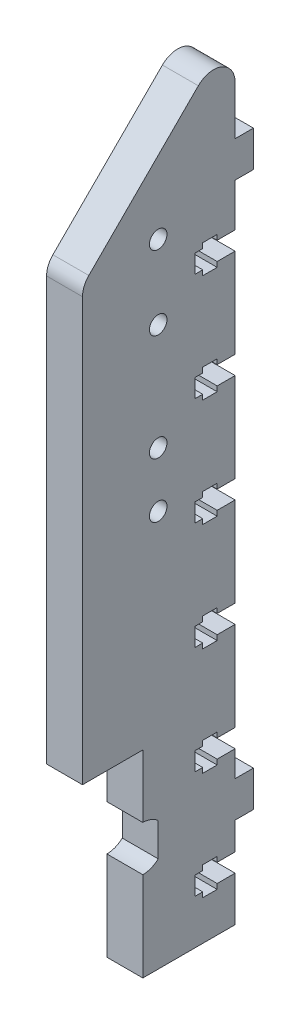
from build123d import *

# Parameters (mm, degrees)
SKETCH1_W           = 12.7
SKETCH1_H           = 276.459229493
BOSS_EXTRUDE1_DEPTH = 53.975
CUT_EXTRUDE1_DEPTH  = 282.965062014
FILLET1_R           = 7.62
CUT_EXTRUDE2_DEPTH  = 272.407453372
SKETCH4_R           = 3.1
CUT_EXTRUDE3_DEPTH  = 272.407453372
CUT_EXTRUDE4_DEPTH  = 272.407453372
SKETCH6_W           = 6.477
SKETCH6_H           = 12.7
BOSS_EXTRUDE2_DEPTH = 12.7


with BuildPart() as part:
    # Sketch1 → Boss-Extrude1 (new body)
    with BuildSketch(Plane.XY):
        with Locations((-6.35, 138.229614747)):
            Rectangle(SKETCH1_W, SKETCH1_H)
    extrude(amount=BOSS_EXTRUDE1_DEPTH)

    # Sketch2 → Cut-Extrude1 (cut, through all)
    with BuildSketch(Plane(origin=(0, 0, 0), x_dir=(0, 0, -1), z_dir=(1, 0, 0))):
        Polygon((0, 276.459229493), (-53.975, 222.484229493), (-53.975, 276.459229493), align=None)
    extrude(amount=-CUT_EXTRUDE1_DEPTH, mode=Mode.SUBTRACT)

    # Fillet1
    fillet1_edges = [part.edges().sort_by_distance(p)[0] for p in [
        (-6.35, 222.484229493, 53.975),
        (-6.35, 276.459229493, 0),
    ]]
    fillet(fillet1_edges, radius=FILLET1_R)

    # Sketch3 → Cut-Extrude2 (cut, through all)
    with BuildSketch(Plane(origin=(0, 0, 0), x_dir=(0, 0, -1), z_dir=(1, 0, 0))):
        with BuildLine():
            Line((-32.635361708, 31.638980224), (-32.635361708, 0))
            Line((-32.635361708, 0), (-53.975, 0))
            Line((-53.975, 0), (-53.975, 69.85))
            Line((-53.975, 69.85), (-32.635361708, 69.85))
            Line((-32.635361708, 69.85), (-32.635361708, 47.638980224))
            ThreePointArc((-32.635361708, 47.638980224), (-29.713510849, 47.086314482), (-27.195361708, 45.504677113))
            Line((-27.195361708, 45.504677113), (-27.195361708, 33.773283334))
            ThreePointArc((-27.195361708, 33.773283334), (-29.713510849, 32.191645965), (-32.635361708, 31.638980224))
        make_face()
    extrude(amount=-CUT_EXTRUDE2_DEPTH, mode=Mode.SUBTRACT)

    # Sketch4 → Cut-Extrude3 (cut, through all)
    with BuildSketch(Plane(origin=(0, 0, 0), x_dir=(0, 0, -1), z_dir=(1, 0, 0))):
        with Locations((-27.195361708, 197.356609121)):
            Circle(SKETCH4_R)
        with Locations((-27.195361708, 223.518609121)):
            Circle(SKETCH4_R)
        with Locations((-27.195361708, 159.637609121)):
            Circle(SKETCH4_R)
        with Locations((-27.195361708, 140.206609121)):
            Circle(SKETCH4_R)
    extrude(amount=-CUT_EXTRUDE3_DEPTH, mode=Mode.SUBTRACT)

    # Sketch5 → Cut-Extrude4 (cut, through all)
    with BuildSketch(Plane(origin=(0, 0, 0), x_dir=(0, 0, -1), z_dir=(1, 0, 0))):
        Polygon((0, 22.3), (-6.35, 22.3), (-6.35, 24.1), (-11.45, 24.1), (-11.45, 22.3), (-14.224, 22.3), (-14.224, 15.8), (-11.45, 15.8), (-11.45, 14), (-6.35, 14), (-6.35, 15.8), (0, 15.8), align=None)
        Polygon((0, 53.9), (-6.35, 53.9), (-6.35, 52.1), (-11.45, 52.1), (-11.45, 53.9), (-14.224, 53.9), (-14.224, 60.4), (-11.45, 60.4), (-11.45, 62.2), (-6.35, 62.2), (-6.35, 60.4), (0, 60.4), align=None)
        Polygon((0, 92), (-6.35, 92), (-6.35, 90.2), (-11.45, 90.2), (-11.45, 92), (-14.224, 92), (-14.224, 98.5), (-11.45, 98.5), (-11.45, 100.3), (-6.35, 100.3), (-6.35, 98.5), (0, 98.5), align=None)
        Polygon((0, 130.1), (-6.35, 130.1), (-6.35, 128.3), (-11.45, 128.3), (-11.45, 130.1), (-14.224, 130.1), (-14.224, 136.6), (-11.45, 136.6), (-11.45, 138.4), (-6.35, 138.4), (-6.35, 136.6), (0, 136.6), align=None)
        Polygon((0, 168.2), (-6.35, 168.2), (-6.35, 166.4), (-11.45, 166.4), (-11.45, 168.2), (-14.224, 168.2), (-14.224, 174.7), (-11.45, 174.7), (-11.45, 176.5), (-6.35, 176.5), (-6.35, 174.7), (0, 174.7), align=None)
        Polygon((0, 206.3), (-6.35, 206.3), (-6.35, 204.5), (-11.45, 204.5), (-11.45, 206.3), (-14.224, 206.3), (-14.224, 212.8), (-11.45, 212.8), (-11.45, 214.6), (-6.35, 214.6), (-6.35, 212.8), (0, 212.8), align=None)
    extrude(amount=-CUT_EXTRUDE4_DEPTH, mode=Mode.SUBTRACT)

    # Sketch6 → Boss-Extrude2 (add)
    with BuildSketch(Plane(origin=(0, 0, 0), x_dir=(0, 0, -1), z_dir=(1, 0, 0))):
        with Locations((3.2385, 234.39)):
            Rectangle(SKETCH6_W, SKETCH6_H)
        with Locations((3.2385, 38.39)):
            Rectangle(SKETCH6_W, SKETCH6_H)
    extrude(amount=-BOSS_EXTRUDE2_DEPTH)


solid = part.part
